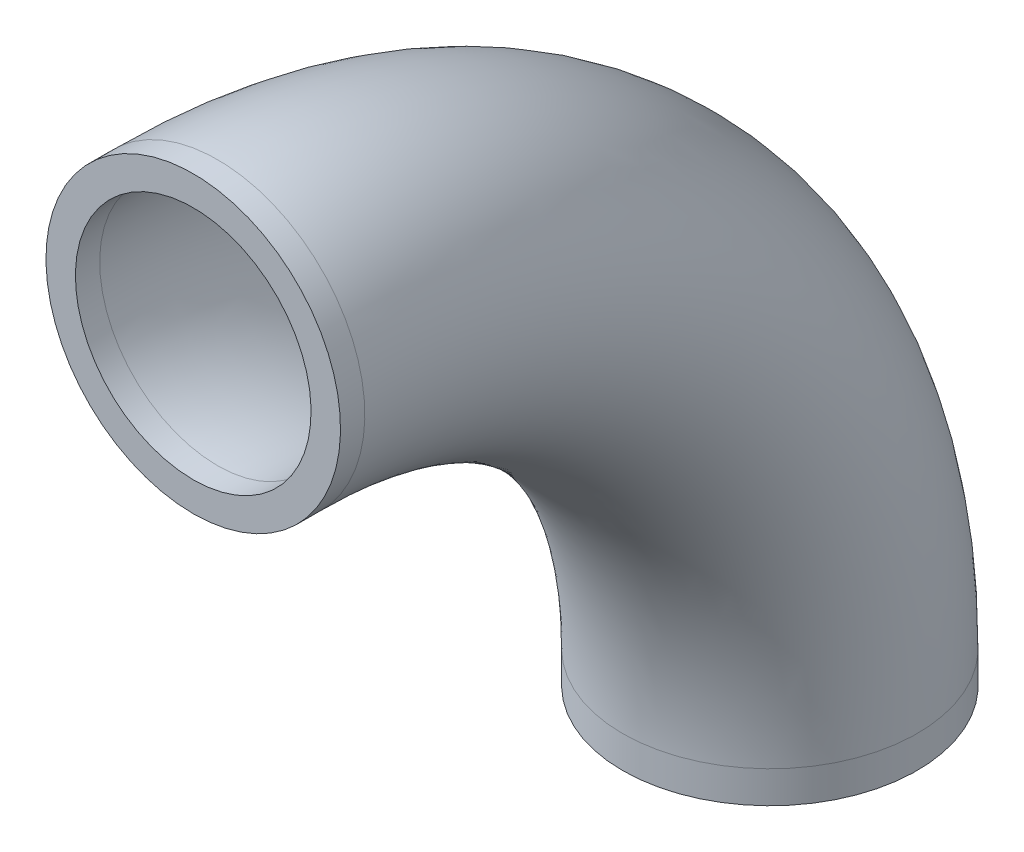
ISO-10303-21;
HEADER;
FILE_DESCRIPTION(('STEP AP214'),'2;1');
FILE_NAME('part.step','',(''),(''),'','','');
FILE_SCHEMA(('AUTOMOTIVE_DESIGN { 1 0 10303 214 1 1 1 1 }'));
ENDSEC;
DATA;
#1=APPLICATION_CONTEXT('core data for automotive mechanical design processes');
#2=APPLICATION_PROTOCOL_DEFINITION('international standard','automotive_design',2000,#1);
#3=PRODUCT_CONTEXT('',#1,'mechanical');
#4=PRODUCT('Part','Part','',(#3));
#5=PRODUCT_RELATED_PRODUCT_CATEGORY('part','',(#4));
#6=PRODUCT_DEFINITION_FORMATION('','',#4);
#7=PRODUCT_DEFINITION_CONTEXT('part definition',#1,'design');
#8=PRODUCT_DEFINITION('design','',#6,#7);
#9=PRODUCT_DEFINITION_SHAPE('','',#8);
#10=(LENGTH_UNIT() NAMED_UNIT(*) SI_UNIT(.MILLI.,.METRE.));
#11=(NAMED_UNIT(*) PLANE_ANGLE_UNIT() SI_UNIT($,.RADIAN.));
#12=(NAMED_UNIT(*) SI_UNIT($,.STERADIAN.) SOLID_ANGLE_UNIT());
#13=UNCERTAINTY_MEASURE_WITH_UNIT(LENGTH_MEASURE(1.E-05),#10,'distance_accuracy_value','');
#14=(GEOMETRIC_REPRESENTATION_CONTEXT(3) GLOBAL_UNCERTAINTY_ASSIGNED_CONTEXT((#13)) GLOBAL_UNIT_ASSIGNED_CONTEXT((#10,
#11,#12)) REPRESENTATION_CONTEXT('',''));
#15=CARTESIAN_POINT('',(0.,0.,0.));
#16=DIRECTION('',(0.,0.,1.));
#17=DIRECTION('',(1.,0.,0.));
#18=AXIS2_PLACEMENT_3D('',#15,#16,#17);
#19=CARTESIAN_POINT('',(0.,-36.565,0.));
#20=DIRECTION('',(0.,0.,1.));
#21=DIRECTION('',(0.,-1.,0.));
#22=AXIS2_PLACEMENT_3D('',#19,#20,#21);
#23=CYLINDRICAL_SURFACE('',#22,1.6);
#24=CARTESIAN_POINT('',(0.,-36.565,0.));
#25=DIRECTION('',(0.,0.,-1.));
#26=DIRECTION('',(0.,1.,0.));
#27=AXIS2_PLACEMENT_3D('',#24,#25,#26);
#28=CIRCLE('',#27,1.6);
#29=CARTESIAN_POINT('',(0.,-38.165,0.));
#30=VERTEX_POINT('',#29);
#31=EDGE_CURVE('E70',#30,#30,#28,.T.);
#32=ORIENTED_EDGE('',*,*,#31,.T.);
#33=DIRECTION('',(0.,0.,1.));
#34=VECTOR('',#33,1.);
#35=CARTESIAN_POINT('',(0.,-38.165,0.));
#36=LINE('',#35,#34);
#37=CARTESIAN_POINT('',(0.,-38.165,0.33));
#38=VERTEX_POINT('',#37);
#39=EDGE_CURVE('E10',#30,#38,#36,.T.);
#40=ORIENTED_EDGE('',*,*,#39,.T.);
#41=CARTESIAN_POINT('',(0.,-36.565,0.33));
#42=DIRECTION('',(0.,0.,1.));
#43=DIRECTION('',(0.,-1.,0.));
#44=AXIS2_PLACEMENT_3D('',#41,#42,#43);
#45=CIRCLE('',#44,1.6);
#46=EDGE_CURVE('E27',#38,#38,#45,.T.);
#47=ORIENTED_EDGE('',*,*,#46,.T.);
#48=ORIENTED_EDGE('',*,*,#39,.F.);
#49=EDGE_LOOP('',(#32,#40,#47,#48));
#50=FACE_BOUND('',#49,.T.);
#51=ADVANCED_FACE('F16',(#50),#23,.F.);
#52=CARTESIAN_POINT('',(0.,-36.565,0.33));
#53=DIRECTION('',(0.,0.,1.));
#54=DIRECTION('',(0.,-1.,0.));
#55=AXIS2_PLACEMENT_3D('',#52,#53,#54);
#56=PLANE('',#55);
#57=ORIENTED_EDGE('',*,*,#46,.F.);
#58=EDGE_LOOP('',(#57));
#59=FACE_BOUND('',#58,.T.);
#60=CARTESIAN_POINT('',(0.,-36.565,0.33));
#61=DIRECTION('',(0.,0.,1.));
#62=DIRECTION('',(0.,-1.,0.));
#63=AXIS2_PLACEMENT_3D('',#60,#61,#62);
#64=CIRCLE('',#63,2.);
#65=CARTESIAN_POINT('',(0.,-38.565,0.33));
#66=VERTEX_POINT('',#65);
#67=EDGE_CURVE('E72',#66,#66,#64,.T.);
#68=ORIENTED_EDGE('',*,*,#67,.T.);
#69=EDGE_LOOP('',(#68));
#70=FACE_BOUND('',#69,.T.);
#71=ADVANCED_FACE('F172',(#59,#70),#56,.T.);
#72=CARTESIAN_POINT('',(0.,-44.065,0.));
#73=DIRECTION('',(1.,0.,0.));
#74=DIRECTION('',(0.,0.,-1.));
#75=AXIS2_PLACEMENT_3D('',#72,#73,#74);
#76=TOROIDAL_SURFACE('',#75,7.5,1.6);
#77=CARTESIAN_POINT('',(0.,-44.065,-7.5));
#78=DIRECTION('',(0.,1.,0.));
#79=DIRECTION('',(0.,0.,1.));
#80=AXIS2_PLACEMENT_3D('',#77,#78,#79);
#81=CIRCLE('',#80,1.6);
#82=CARTESIAN_POINT('',(0.,-44.065,-5.9));
#83=VERTEX_POINT('',#82);
#84=EDGE_CURVE('E68',#83,#83,#81,.T.);
#85=ORIENTED_EDGE('',*,*,#84,.F.);
#86=CARTESIAN_POINT('',(0.,-44.065,0.));
#87=DIRECTION('',(1.,0.,0.));
#88=DIRECTION('',(0.,0.,-1.));
#89=AXIS2_PLACEMENT_3D('',#86,#87,#88);
#90=CIRCLE('',#89,5.9);
#91=EDGE_CURVE('E65',#83,#30,#90,.T.);
#92=ORIENTED_EDGE('',*,*,#91,.T.);
#93=ORIENTED_EDGE('',*,*,#31,.F.);
#94=ORIENTED_EDGE('',*,*,#91,.F.);
#95=EDGE_LOOP('',(#85,#92,#93,#94));
#96=FACE_BOUND('',#95,.T.);
#97=ADVANCED_FACE('F67',(#96),#76,.F.);
#98=CARTESIAN_POINT('',(0.,-36.565,0.));
#99=DIRECTION('',(0.,0.,1.));
#100=DIRECTION('',(0.,-1.,0.));
#101=AXIS2_PLACEMENT_3D('',#98,#99,#100);
#102=CYLINDRICAL_SURFACE('',#101,2.);
#103=DIRECTION('',(0.,0.,1.));
#104=VECTOR('',#103,1.);
#105=CARTESIAN_POINT('',(0.,-38.565,0.));
#106=LINE('',#105,#104);
#107=CARTESIAN_POINT('',(0.,-38.565,0.));
#108=VERTEX_POINT('',#107);
#109=EDGE_CURVE('E80',#108,#66,#106,.T.);
#110=ORIENTED_EDGE('',*,*,#109,.T.);
#111=ORIENTED_EDGE('',*,*,#67,.F.);
#112=ORIENTED_EDGE('',*,*,#109,.F.);
#113=CARTESIAN_POINT('',(0.,-36.565,0.));
#114=DIRECTION('',(0.,0.,-1.));
#115=DIRECTION('',(0.,1.,0.));
#116=AXIS2_PLACEMENT_3D('',#113,#114,#115);
#117=CIRCLE('',#116,2.);
#118=EDGE_CURVE('E88',#108,#108,#117,.T.);
#119=ORIENTED_EDGE('',*,*,#118,.F.);
#120=EDGE_LOOP('',(#110,#111,#112,#119));
#121=FACE_BOUND('',#120,.T.);
#122=ADVANCED_FACE('F182',(#121),#102,.T.);
#123=CARTESIAN_POINT('',(0.,-44.5,-7.5));
#124=DIRECTION('',(0.,1.,0.));
#125=DIRECTION('',(0.,0.,1.));
#126=AXIS2_PLACEMENT_3D('',#123,#124,#125);
#127=CYLINDRICAL_SURFACE('',#126,1.6);
#128=CARTESIAN_POINT('',(0.,-44.5,-7.5));
#129=DIRECTION('',(0.,1.,0.));
#130=DIRECTION('',(0.,0.,1.));
#131=AXIS2_PLACEMENT_3D('',#128,#129,#130);
#132=CIRCLE('',#131,1.6);
#133=CARTESIAN_POINT('',(0.,-44.5,-5.9));
#134=VERTEX_POINT('',#133);
#135=EDGE_CURVE('E105',#134,#134,#132,.T.);
#136=ORIENTED_EDGE('',*,*,#135,.F.);
#137=DIRECTION('',(0.,1.,0.));
#138=VECTOR('',#137,1.);
#139=CARTESIAN_POINT('',(0.,-44.5,-5.9));
#140=LINE('',#139,#138);
#141=EDGE_CURVE('E77',#134,#83,#140,.T.);
#142=ORIENTED_EDGE('',*,*,#141,.T.);
#143=ORIENTED_EDGE('',*,*,#84,.T.);
#144=ORIENTED_EDGE('',*,*,#141,.F.);
#145=EDGE_LOOP('',(#136,#142,#143,#144));
#146=FACE_BOUND('',#145,.T.);
#147=ADVANCED_FACE('F76',(#146),#127,.F.);
#148=CARTESIAN_POINT('',(0.,-44.065,0.));
#149=DIRECTION('',(1.,0.,0.));
#150=DIRECTION('',(0.,0.,-1.));
#151=AXIS2_PLACEMENT_3D('',#148,#149,#150);
#152=TOROIDAL_SURFACE('',#151,7.5,2.);
#153=CARTESIAN_POINT('',(0.,-44.065,0.));
#154=DIRECTION('',(1.,0.,0.));
#155=DIRECTION('',(0.,0.,-1.));
#156=AXIS2_PLACEMENT_3D('',#153,#154,#155);
#157=CIRCLE('',#156,5.5);
#158=CARTESIAN_POINT('',(0.,-44.065,-5.5));
#159=VERTEX_POINT('',#158);
#160=EDGE_CURVE('E20',#159,#108,#157,.T.);
#161=ORIENTED_EDGE('',*,*,#160,.T.);
#162=ORIENTED_EDGE('',*,*,#118,.T.);
#163=ORIENTED_EDGE('',*,*,#160,.F.);
#164=CARTESIAN_POINT('',(0.,-44.065,-7.5));
#165=DIRECTION('',(0.,1.,0.));
#166=DIRECTION('',(0.,0.,1.));
#167=AXIS2_PLACEMENT_3D('',#164,#165,#166);
#168=CIRCLE('',#167,2.);
#169=EDGE_CURVE('E92',#159,#159,#168,.T.);
#170=ORIENTED_EDGE('',*,*,#169,.T.);
#171=EDGE_LOOP('',(#161,#162,#163,#170));
#172=FACE_BOUND('',#171,.T.);
#173=ADVANCED_FACE('F162',(#172),#152,.T.);
#174=CARTESIAN_POINT('',(0.,-44.5,-7.5));
#175=DIRECTION('',(0.,1.,0.));
#176=DIRECTION('',(0.,0.,-1.));
#177=AXIS2_PLACEMENT_3D('',#174,#175,#176);
#178=PLANE('',#177);
#179=ORIENTED_EDGE('',*,*,#135,.T.);
#180=EDGE_LOOP('',(#179));
#181=FACE_BOUND('',#180,.T.);
#182=CARTESIAN_POINT('',(0.,-44.5,-7.5));
#183=DIRECTION('',(0.,1.,0.));
#184=DIRECTION('',(0.,0.,1.));
#185=AXIS2_PLACEMENT_3D('',#182,#183,#184);
#186=CIRCLE('',#185,2.);
#187=CARTESIAN_POINT('',(0.,-44.5,-5.5));
#188=VERTEX_POINT('',#187);
#189=EDGE_CURVE('E95',#188,#188,#186,.T.);
#190=ORIENTED_EDGE('',*,*,#189,.F.);
#191=EDGE_LOOP('',(#190));
#192=FACE_BOUND('',#191,.T.);
#193=ADVANCED_FACE('F18',(#181,#192),#178,.F.);
#194=CARTESIAN_POINT('',(0.,-44.5,-7.5));
#195=DIRECTION('',(0.,1.,0.));
#196=DIRECTION('',(0.,0.,1.));
#197=AXIS2_PLACEMENT_3D('',#194,#195,#196);
#198=CYLINDRICAL_SURFACE('',#197,2.);
#199=DIRECTION('',(0.,1.,0.));
#200=VECTOR('',#199,1.);
#201=CARTESIAN_POINT('',(0.,-44.5,-5.5));
#202=LINE('',#201,#200);
#203=EDGE_CURVE('E96',#188,#159,#202,.T.);
#204=ORIENTED_EDGE('',*,*,#203,.T.);
#205=ORIENTED_EDGE('',*,*,#169,.F.);
#206=ORIENTED_EDGE('',*,*,#203,.F.);
#207=ORIENTED_EDGE('',*,*,#189,.T.);
#208=EDGE_LOOP('',(#204,#205,#206,#207));
#209=FACE_BOUND('',#208,.T.);
#210=ADVANCED_FACE('F117',(#209),#198,.T.);
#211=CLOSED_SHELL('',(#51,#71,#97,#122,#147,#173,#193,#210));
#212=MANIFOLD_SOLID_BREP('B1',#211);
#213=ADVANCED_BREP_SHAPE_REPRESENTATION('',(#18,#212),#14);
#214=SHAPE_DEFINITION_REPRESENTATION(#9,#213);
ENDSEC;
END-ISO-10303-21;
